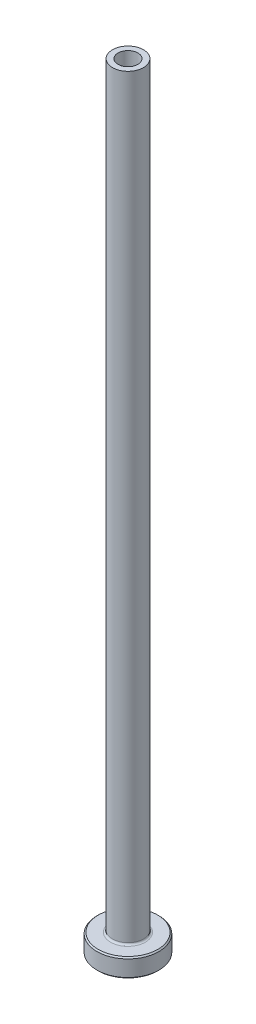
ISO-10303-21;
HEADER;
FILE_DESCRIPTION(('STEP AP214'),'2;1');
FILE_NAME('part.step','',(''),(''),'','','');
FILE_SCHEMA(('AUTOMOTIVE_DESIGN { 1 0 10303 214 1 1 1 1 }'));
ENDSEC;
DATA;
#1=APPLICATION_CONTEXT('core data for automotive mechanical design processes');
#2=APPLICATION_PROTOCOL_DEFINITION('international standard','automotive_design',2000,#1);
#3=PRODUCT_CONTEXT('',#1,'mechanical');
#4=PRODUCT('Part','Part','',(#3));
#5=PRODUCT_RELATED_PRODUCT_CATEGORY('part','',(#4));
#6=PRODUCT_DEFINITION_FORMATION('','',#4);
#7=PRODUCT_DEFINITION_CONTEXT('part definition',#1,'design');
#8=PRODUCT_DEFINITION('design','',#6,#7);
#9=PRODUCT_DEFINITION_SHAPE('','',#8);
#10=(LENGTH_UNIT() NAMED_UNIT(*) SI_UNIT(.MILLI.,.METRE.));
#11=(NAMED_UNIT(*) PLANE_ANGLE_UNIT() SI_UNIT($,.RADIAN.));
#12=(NAMED_UNIT(*) SI_UNIT($,.STERADIAN.) SOLID_ANGLE_UNIT());
#13=UNCERTAINTY_MEASURE_WITH_UNIT(LENGTH_MEASURE(1.E-05),#10,'distance_accuracy_value','');
#14=(GEOMETRIC_REPRESENTATION_CONTEXT(3) GLOBAL_UNCERTAINTY_ASSIGNED_CONTEXT((#13)) GLOBAL_UNIT_ASSIGNED_CONTEXT((#10,
#11,#12)) REPRESENTATION_CONTEXT('',''));
#15=CARTESIAN_POINT('',(0.,0.,0.));
#16=DIRECTION('',(0.,0.,1.));
#17=DIRECTION('',(1.,0.,0.));
#18=AXIS2_PLACEMENT_3D('',#15,#16,#17);
#19=CARTESIAN_POINT('',(0.,92.1876809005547,0.));
#20=DIRECTION('',(0.,1.,0.));
#21=DIRECTION('',(0.,0.,1.));
#22=AXIS2_PLACEMENT_3D('',#19,#20,#21);
#23=CYLINDRICAL_SURFACE('',#22,1.6);
#24=CARTESIAN_POINT('',(0.,125.,0.));
#25=DIRECTION('',(0.,1.,0.));
#26=DIRECTION('',(0.,0.,1.));
#27=AXIS2_PLACEMENT_3D('',#24,#25,#26);
#28=CIRCLE('',#27,1.6);
#29=CARTESIAN_POINT('',(0.,125.,1.6));
#30=VERTEX_POINT('',#29);
#31=EDGE_CURVE('E62',#30,#30,#28,.T.);
#32=ORIENTED_EDGE('',*,*,#31,.T.);
#33=EDGE_LOOP('',(#32));
#34=FACE_BOUND('',#33,.T.);
#35=CARTESIAN_POINT('',(0.,80.,0.));
#36=DIRECTION('',(0.,1.,0.));
#37=DIRECTION('',(0.,0.,1.));
#38=AXIS2_PLACEMENT_3D('',#35,#36,#37);
#39=CIRCLE('',#38,1.6);
#40=CARTESIAN_POINT('',(0.,80.,1.6));
#41=VERTEX_POINT('',#40);
#42=EDGE_CURVE('E71',#41,#41,#39,.T.);
#43=ORIENTED_EDGE('',*,*,#42,.F.);
#44=EDGE_LOOP('',(#43));
#45=FACE_BOUND('',#44,.T.);
#46=ADVANCED_FACE('F30',(#34,#45),#23,.F.);
#47=CARTESIAN_POINT('',(-1.6,125.,0.));
#48=DIRECTION('',(0.,1.,0.));
#49=DIRECTION('',(0.,0.,1.));
#50=AXIS2_PLACEMENT_3D('',#47,#48,#49);
#51=PLANE('',#50);
#52=CARTESIAN_POINT('',(0.,125.,0.));
#53=DIRECTION('',(0.,1.,0.));
#54=DIRECTION('',(0.,0.,1.));
#55=AXIS2_PLACEMENT_3D('',#52,#53,#54);
#56=CIRCLE('',#55,2.5);
#57=CARTESIAN_POINT('',(0.,125.,2.5));
#58=VERTEX_POINT('',#57);
#59=EDGE_CURVE('E65',#58,#58,#56,.T.);
#60=ORIENTED_EDGE('',*,*,#59,.T.);
#61=EDGE_LOOP('',(#60));
#62=FACE_BOUND('',#61,.T.);
#63=ORIENTED_EDGE('',*,*,#31,.F.);
#64=EDGE_LOOP('',(#63));
#65=FACE_BOUND('',#64,.T.);
#66=ADVANCED_FACE('F79',(#62,#65),#51,.T.);
#67=CARTESIAN_POINT('',(0.,92.1876809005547,0.));
#68=DIRECTION('',(0.,1.,0.));
#69=DIRECTION('',(0.,0.,1.));
#70=AXIS2_PLACEMENT_3D('',#67,#68,#69);
#71=CYLINDRICAL_SURFACE('',#70,2.5);
#72=CARTESIAN_POINT('',(0.,3.3,0.));
#73=DIRECTION('',(0.,1.,0.));
#74=DIRECTION('',(0.,0.,1.));
#75=AXIS2_PLACEMENT_3D('',#72,#73,#74);
#76=CIRCLE('',#75,2.5);
#77=CARTESIAN_POINT('',(0.,3.3,2.5));
#78=VERTEX_POINT('',#77);
#79=EDGE_CURVE('E59',#78,#78,#76,.T.);
#80=ORIENTED_EDGE('',*,*,#79,.T.);
#81=EDGE_LOOP('',(#80));
#82=FACE_BOUND('',#81,.T.);
#83=ORIENTED_EDGE('',*,*,#59,.F.);
#84=EDGE_LOOP('',(#83));
#85=FACE_BOUND('',#84,.T.);
#86=ADVANCED_FACE('F85',(#82,#85),#71,.T.);
#87=CARTESIAN_POINT('',(-2.49999999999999,3.,0.));
#88=DIRECTION('',(0.,1.,0.));
#89=DIRECTION('',(0.,0.,1.));
#90=AXIS2_PLACEMENT_3D('',#87,#88,#89);
#91=PLANE('',#90);
#92=CARTESIAN_POINT('',(0.,3.,0.));
#93=DIRECTION('',(0.,1.,0.));
#94=DIRECTION('',(0.,0.,1.));
#95=AXIS2_PLACEMENT_3D('',#92,#93,#94);
#96=CIRCLE('',#95,4.80000000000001);
#97=CARTESIAN_POINT('',(0.,3.,4.80000000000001));
#98=VERTEX_POINT('',#97);
#99=EDGE_CURVE('E53',#98,#98,#96,.T.);
#100=ORIENTED_EDGE('',*,*,#99,.T.);
#101=EDGE_LOOP('',(#100));
#102=FACE_BOUND('',#101,.T.);
#103=CARTESIAN_POINT('',(0.,3.,0.));
#104=DIRECTION('',(0.,1.,0.));
#105=DIRECTION('',(0.,0.,1.));
#106=AXIS2_PLACEMENT_3D('',#103,#104,#105);
#107=CIRCLE('',#106,2.8);
#108=CARTESIAN_POINT('',(0.,3.,2.8));
#109=VERTEX_POINT('',#108);
#110=EDGE_CURVE('E56',#109,#109,#107,.F.);
#111=ORIENTED_EDGE('',*,*,#110,.T.);
#112=EDGE_LOOP('',(#111));
#113=FACE_BOUND('',#112,.T.);
#114=ADVANCED_FACE('F111',(#102,#113),#91,.T.);
#115=CARTESIAN_POINT('',(0.,92.1876809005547,0.));
#116=DIRECTION('',(0.,1.,0.));
#117=DIRECTION('',(0.,0.,1.));
#118=AXIS2_PLACEMENT_3D('',#115,#116,#117);
#119=CYLINDRICAL_SURFACE('',#118,4.99999999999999);
#120=CARTESIAN_POINT('',(0.,2.80000000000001,0.));
#121=DIRECTION('',(0.,1.,0.));
#122=DIRECTION('',(0.,0.,1.));
#123=AXIS2_PLACEMENT_3D('',#120,#121,#122);
#124=CIRCLE('',#123,4.99999999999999);
#125=CARTESIAN_POINT('',(0.,2.80000000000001,4.99999999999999));
#126=VERTEX_POINT('',#125);
#127=EDGE_CURVE('E45',#126,#126,#124,.F.);
#128=ORIENTED_EDGE('',*,*,#127,.T.);
#129=EDGE_LOOP('',(#128));
#130=FACE_BOUND('',#129,.T.);
#131=CARTESIAN_POINT('',(0.,0.20000000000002,0.));
#132=DIRECTION('',(0.,-1.,0.));
#133=DIRECTION('',(0.,0.,-1.));
#134=AXIS2_PLACEMENT_3D('',#131,#132,#133);
#135=CIRCLE('',#134,4.99999999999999);
#136=CARTESIAN_POINT('',(0.,0.20000000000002,-4.99999999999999));
#137=VERTEX_POINT('',#136);
#138=EDGE_CURVE('E50',#137,#137,#135,.F.);
#139=ORIENTED_EDGE('',*,*,#138,.T.);
#140=EDGE_LOOP('',(#139));
#141=FACE_BOUND('',#140,.T.);
#142=ADVANCED_FACE('F108',(#130,#141),#119,.T.);
#143=CARTESIAN_POINT('',(-4.99999999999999,0.,0.));
#144=DIRECTION('',(0.,-1.,0.));
#145=DIRECTION('',(0.,0.,-1.));
#146=AXIS2_PLACEMENT_3D('',#143,#144,#145);
#147=PLANE('',#146);
#148=CARTESIAN_POINT('',(0.,0.,0.));
#149=DIRECTION('',(0.,-1.,0.));
#150=DIRECTION('',(0.,0.,-1.));
#151=AXIS2_PLACEMENT_3D('',#148,#149,#150);
#152=CIRCLE('',#151,2.34999999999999);
#153=CARTESIAN_POINT('',(0.,0.,-2.34999999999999));
#154=VERTEX_POINT('',#153);
#155=EDGE_CURVE('E37',#154,#154,#152,.F.);
#156=ORIENTED_EDGE('',*,*,#155,.T.);
#157=EDGE_LOOP('',(#156));
#158=FACE_BOUND('',#157,.T.);
#159=CARTESIAN_POINT('',(0.,0.,0.));
#160=DIRECTION('',(0.,-1.,0.));
#161=DIRECTION('',(0.,0.,-1.));
#162=AXIS2_PLACEMENT_3D('',#159,#160,#161);
#163=CIRCLE('',#162,4.79999999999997);
#164=CARTESIAN_POINT('',(0.,0.,-4.79999999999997));
#165=VERTEX_POINT('',#164);
#166=EDGE_CURVE('E41',#165,#165,#163,.T.);
#167=ORIENTED_EDGE('',*,*,#166,.T.);
#168=EDGE_LOOP('',(#167));
#169=FACE_BOUND('',#168,.T.);
#170=ADVANCED_FACE('F110',(#158,#169),#147,.T.);
#171=CARTESIAN_POINT('',(0.,92.1876809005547,0.));
#172=DIRECTION('',(0.,1.,0.));
#173=DIRECTION('',(0.,0.,1.));
#174=AXIS2_PLACEMENT_3D('',#171,#172,#173);
#175=CYLINDRICAL_SURFACE('',#174,1.84999999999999);
#176=CARTESIAN_POINT('',(0.,0.499999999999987,0.));
#177=DIRECTION('',(0.,-1.,0.));
#178=DIRECTION('',(0.,0.,-1.));
#179=AXIS2_PLACEMENT_3D('',#176,#177,#178);
#180=CIRCLE('',#179,1.84999999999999);
#181=CARTESIAN_POINT('',(0.,0.499999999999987,-1.84999999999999));
#182=VERTEX_POINT('',#181);
#183=EDGE_CURVE('E10',#182,#182,#180,.T.);
#184=ORIENTED_EDGE('',*,*,#183,.T.);
#185=EDGE_LOOP('',(#184));
#186=FACE_BOUND('',#185,.T.);
#187=CARTESIAN_POINT('',(0.,68.,0.));
#188=DIRECTION('',(0.,1.,0.));
#189=DIRECTION('',(0.,0.,1.));
#190=AXIS2_PLACEMENT_3D('',#187,#188,#189);
#191=CIRCLE('',#190,1.85);
#192=CARTESIAN_POINT('',(0.,68.,1.85));
#193=VERTEX_POINT('',#192);
#194=EDGE_CURVE('E68',#193,#193,#191,.T.);
#195=ORIENTED_EDGE('',*,*,#194,.T.);
#196=EDGE_LOOP('',(#195));
#197=FACE_BOUND('',#196,.T.);
#198=ADVANCED_FACE('F118',(#186,#197),#175,.F.);
#199=CARTESIAN_POINT('',(0.,68.,0.));
#200=DIRECTION('',(0.,-1.,0.));
#201=DIRECTION('',(0.,0.,-1.));
#202=AXIS2_PLACEMENT_3D('',#199,#200,#201);
#203=CONICAL_SURFACE('',#202,1.85,0.0208303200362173);
#204=ORIENTED_EDGE('',*,*,#42,.T.);
#205=EDGE_LOOP('',(#204));
#206=FACE_BOUND('',#205,.T.);
#207=ORIENTED_EDGE('',*,*,#194,.F.);
#208=EDGE_LOOP('',(#207));
#209=FACE_BOUND('',#208,.T.);
#210=ADVANCED_FACE('F75',(#206,#209),#203,.F.);
#211=CARTESIAN_POINT('',(0.,3.3,0.));
#212=DIRECTION('',(0.,1.,0.));
#213=DIRECTION('',(0.,0.,1.));
#214=AXIS2_PLACEMENT_3D('',#211,#212,#213);
#215=TOROIDAL_SURFACE('',#214,2.8,0.3);
#216=ORIENTED_EDGE('',*,*,#110,.F.);
#217=EDGE_LOOP('',(#216));
#218=FACE_BOUND('',#217,.T.);
#219=ORIENTED_EDGE('',*,*,#79,.F.);
#220=EDGE_LOOP('',(#219));
#221=FACE_BOUND('',#220,.T.);
#222=ADVANCED_FACE('F90',(#218,#221),#215,.F.);
#223=CARTESIAN_POINT('',(0.,3.,0.));
#224=DIRECTION('',(0.,-1.,0.));
#225=DIRECTION('',(0.,0.,-1.));
#226=AXIS2_PLACEMENT_3D('',#223,#224,#225);
#227=CONICAL_SURFACE('',#226,4.80000000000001,0.785398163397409);
#228=ORIENTED_EDGE('',*,*,#127,.F.);
#229=EDGE_LOOP('',(#228));
#230=FACE_BOUND('',#229,.T.);
#231=ORIENTED_EDGE('',*,*,#99,.F.);
#232=EDGE_LOOP('',(#231));
#233=FACE_BOUND('',#232,.T.);
#234=ADVANCED_FACE('F93',(#230,#233),#227,.T.);
#235=CARTESIAN_POINT('',(0.,0.20000000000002,0.));
#236=DIRECTION('',(0.,1.,0.));
#237=DIRECTION('',(0.,0.,1.));
#238=AXIS2_PLACEMENT_3D('',#235,#236,#237);
#239=CONICAL_SURFACE('',#238,4.99999999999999,0.785398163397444);
#240=ORIENTED_EDGE('',*,*,#166,.F.);
#241=EDGE_LOOP('',(#240));
#242=FACE_BOUND('',#241,.T.);
#243=ORIENTED_EDGE('',*,*,#138,.F.);
#244=EDGE_LOOP('',(#243));
#245=FACE_BOUND('',#244,.T.);
#246=ADVANCED_FACE('F96',(#242,#245),#239,.T.);
#247=CARTESIAN_POINT('',(0.,0.,0.));
#248=DIRECTION('',(0.,-1.,0.));
#249=DIRECTION('',(0.,0.,-1.));
#250=AXIS2_PLACEMENT_3D('',#247,#248,#249);
#251=CONICAL_SURFACE('',#250,2.34999999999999,0.785398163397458);
#252=ORIENTED_EDGE('',*,*,#183,.F.);
#253=EDGE_LOOP('',(#252));
#254=FACE_BOUND('',#253,.T.);
#255=ORIENTED_EDGE('',*,*,#155,.F.);
#256=EDGE_LOOP('',(#255));
#257=FACE_BOUND('',#256,.T.);
#258=ADVANCED_FACE('F32',(#254,#257),#251,.F.);
#259=CLOSED_SHELL('',(#46,#66,#86,#114,#142,#170,#198,#210,#222,#234,#246,#258));
#260=MANIFOLD_SOLID_BREP('B2',#259);
#261=ADVANCED_BREP_SHAPE_REPRESENTATION('',(#18,#260),#14);
#262=SHAPE_DEFINITION_REPRESENTATION(#9,#261);
ENDSEC;
END-ISO-10303-21;
